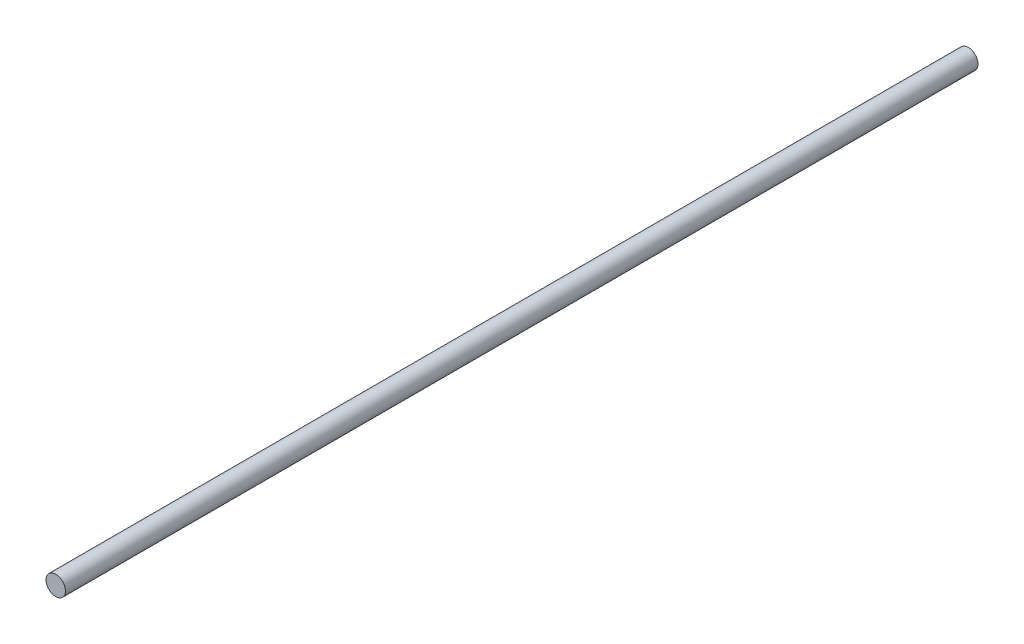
from build123d import *

# Parameters (mm, degrees)
BOSS_EXTRUDE1_DEPTH      = 300
BOSS_EXTRUDE1_DEPTH_BACK = 75
SKETCH1_R                = 4


with BuildPart() as part:
    # Sketch1 → Boss-Extrude1 (new, two sides: drawn at the far end of the back side and taken through both)
    with BuildSketch(Plane.XY.offset(-BOSS_EXTRUDE1_DEPTH_BACK)):
        with Locations((-24.481638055, 51.143583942)):
            Circle(SKETCH1_R)
    extrude(amount=BOSS_EXTRUDE1_DEPTH + BOSS_EXTRUDE1_DEPTH_BACK)


solid = part.part
